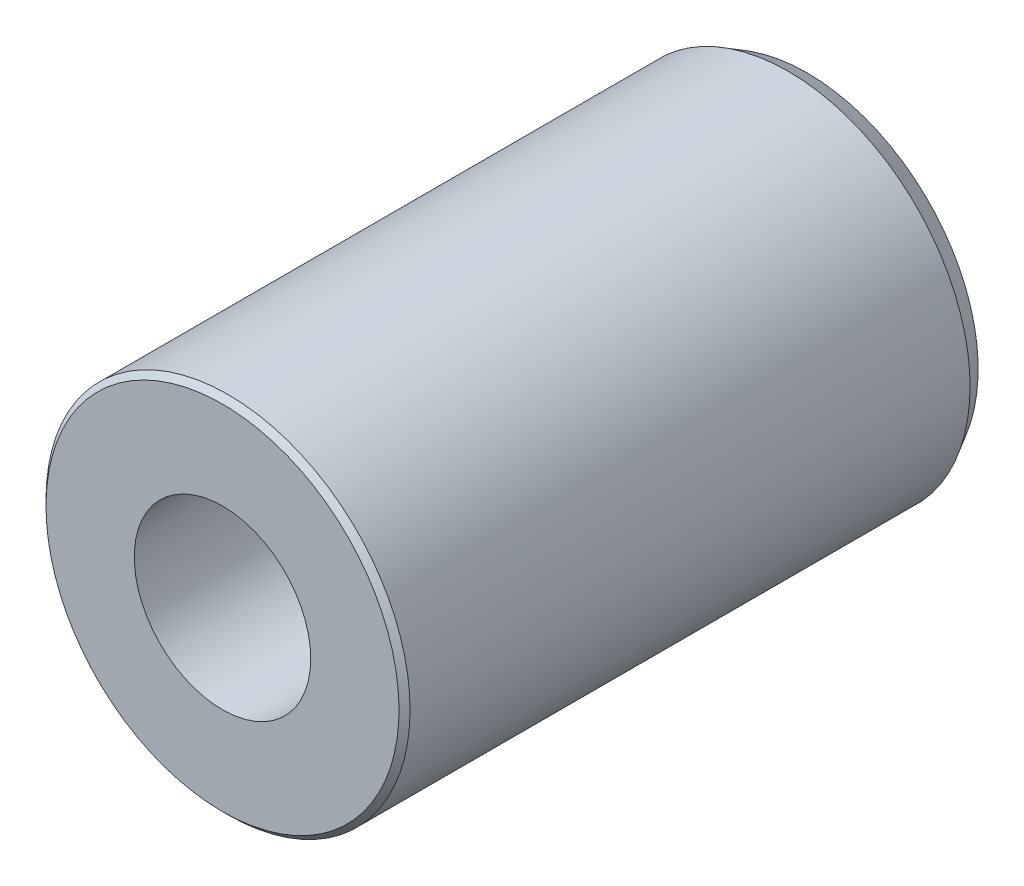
ISO-10303-21;
HEADER;
FILE_DESCRIPTION(('STEP AP214'),'2;1');
FILE_NAME('part.step','',(''),(''),'','','');
FILE_SCHEMA(('AUTOMOTIVE_DESIGN { 1 0 10303 214 1 1 1 1 }'));
ENDSEC;
DATA;
#1=APPLICATION_CONTEXT('core data for automotive mechanical design processes');
#2=APPLICATION_PROTOCOL_DEFINITION('international standard','automotive_design',2000,#1);
#3=PRODUCT_CONTEXT('',#1,'mechanical');
#4=PRODUCT('Part','Part','',(#3));
#5=PRODUCT_RELATED_PRODUCT_CATEGORY('part','',(#4));
#6=PRODUCT_DEFINITION_FORMATION('','',#4);
#7=PRODUCT_DEFINITION_CONTEXT('part definition',#1,'design');
#8=PRODUCT_DEFINITION('design','',#6,#7);
#9=PRODUCT_DEFINITION_SHAPE('','',#8);
#10=(LENGTH_UNIT() NAMED_UNIT(*) SI_UNIT(.MILLI.,.METRE.));
#11=(NAMED_UNIT(*) PLANE_ANGLE_UNIT() SI_UNIT($,.RADIAN.));
#12=(NAMED_UNIT(*) SI_UNIT($,.STERADIAN.) SOLID_ANGLE_UNIT());
#13=UNCERTAINTY_MEASURE_WITH_UNIT(LENGTH_MEASURE(1.E-05),#10,'distance_accuracy_value','');
#14=(GEOMETRIC_REPRESENTATION_CONTEXT(3) GLOBAL_UNCERTAINTY_ASSIGNED_CONTEXT((#13)) GLOBAL_UNIT_ASSIGNED_CONTEXT((#10,
#11,#12)) REPRESENTATION_CONTEXT('',''));
#15=CARTESIAN_POINT('',(0.,0.,0.));
#16=DIRECTION('',(0.,0.,1.));
#17=DIRECTION('',(1.,0.,0.));
#18=AXIS2_PLACEMENT_3D('',#15,#16,#17);
#19=CARTESIAN_POINT('',(0.,0.,53.));
#20=DIRECTION('',(0.,0.,1.));
#21=DIRECTION('',(0.,-1.,0.));
#22=AXIS2_PLACEMENT_3D('',#19,#20,#21);
#23=PLANE('',#22);
#24=CARTESIAN_POINT('',(0.,0.,53.));
#25=DIRECTION('',(0.,0.,1.));
#26=DIRECTION('',(0.,-1.,0.));
#27=AXIS2_PLACEMENT_3D('',#24,#25,#26);
#28=CIRCLE('',#27,16.);
#29=CARTESIAN_POINT('',(0.,-16.,53.));
#30=VERTEX_POINT('',#29);
#31=EDGE_CURVE('E29',#30,#30,#28,.T.);
#32=ORIENTED_EDGE('',*,*,#31,.T.);
#33=EDGE_LOOP('',(#32));
#34=FACE_BOUND('',#33,.T.);
#35=CARTESIAN_POINT('',(0.,0.,53.));
#36=DIRECTION('',(0.,0.,1.));
#37=DIRECTION('',(1.,0.,0.));
#38=AXIS2_PLACEMENT_3D('',#35,#36,#37);
#39=CIRCLE('',#38,8.);
#40=CARTESIAN_POINT('',(8.,0.,53.));
#41=VERTEX_POINT('',#40);
#42=EDGE_CURVE('E37',#41,#41,#39,.T.);
#43=ORIENTED_EDGE('',*,*,#42,.F.);
#44=EDGE_LOOP('',(#43));
#45=FACE_BOUND('',#44,.T.);
#46=ADVANCED_FACE('F14',(#34,#45),#23,.T.);
#47=CARTESIAN_POINT('',(0.,0.,0.));
#48=DIRECTION('',(0.,0.,1.));
#49=DIRECTION('',(0.,-1.,0.));
#50=AXIS2_PLACEMENT_3D('',#47,#48,#49);
#51=PLANE('',#50);
#52=CARTESIAN_POINT('',(0.,0.,0.));
#53=DIRECTION('',(0.,0.,1.));
#54=DIRECTION('',(0.,-1.,0.));
#55=AXIS2_PLACEMENT_3D('',#52,#53,#54);
#56=CIRCLE('',#55,15.5);
#57=CARTESIAN_POINT('',(0.,-15.5,0.));
#58=VERTEX_POINT('',#57);
#59=EDGE_CURVE('E10',#58,#58,#56,.F.);
#60=ORIENTED_EDGE('',*,*,#59,.T.);
#61=EDGE_LOOP('',(#60));
#62=FACE_BOUND('',#61,.T.);
#63=CARTESIAN_POINT('',(0.,0.,0.));
#64=DIRECTION('',(0.,0.,1.));
#65=DIRECTION('',(0.,-1.,0.));
#66=AXIS2_PLACEMENT_3D('',#63,#64,#65);
#67=CIRCLE('',#66,8.);
#68=CARTESIAN_POINT('',(0.,-8.,0.));
#69=VERTEX_POINT('',#68);
#70=EDGE_CURVE('E34',#69,#69,#67,.F.);
#71=ORIENTED_EDGE('',*,*,#70,.F.);
#72=EDGE_LOOP('',(#71));
#73=FACE_BOUND('',#72,.T.);
#74=ADVANCED_FACE('F45',(#62,#73),#51,.F.);
#75=CARTESIAN_POINT('',(0.,0.,53.));
#76=DIRECTION('',(0.,0.,-1.));
#77=DIRECTION('',(0.,1.,0.));
#78=AXIS2_PLACEMENT_3D('',#75,#76,#77);
#79=CYLINDRICAL_SURFACE('',#78,16.5);
#80=CARTESIAN_POINT('',(0.,0.,1.73205080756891));
#81=DIRECTION('',(0.,0.,1.));
#82=DIRECTION('',(0.,-1.,0.));
#83=AXIS2_PLACEMENT_3D('',#80,#81,#82);
#84=CIRCLE('',#83,16.5);
#85=CARTESIAN_POINT('',(0.,-16.5,1.73205080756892));
#86=VERTEX_POINT('',#85);
#87=EDGE_CURVE('E21',#86,#86,#84,.T.);
#88=ORIENTED_EDGE('',*,*,#87,.T.);
#89=EDGE_LOOP('',(#88));
#90=FACE_BOUND('',#89,.T.);
#91=CARTESIAN_POINT('',(0.,0.,52.5));
#92=DIRECTION('',(0.,0.,1.));
#93=DIRECTION('',(0.,-1.,0.));
#94=AXIS2_PLACEMENT_3D('',#91,#92,#93);
#95=CIRCLE('',#94,16.5);
#96=CARTESIAN_POINT('',(0.,-16.5,52.5));
#97=VERTEX_POINT('',#96);
#98=EDGE_CURVE('E25',#97,#97,#95,.F.);
#99=ORIENTED_EDGE('',*,*,#98,.T.);
#100=EDGE_LOOP('',(#99));
#101=FACE_BOUND('',#100,.T.);
#102=ADVANCED_FACE('F16',(#90,#101),#79,.T.);
#103=CARTESIAN_POINT('',(0.,0.,53.));
#104=DIRECTION('',(0.,0.,1.));
#105=DIRECTION('',(1.,0.,0.));
#106=AXIS2_PLACEMENT_3D('',#103,#104,#105);
#107=CYLINDRICAL_SURFACE('',#106,8.);
#108=ORIENTED_EDGE('',*,*,#42,.T.);
#109=EDGE_LOOP('',(#108));
#110=FACE_BOUND('',#109,.T.);
#111=ORIENTED_EDGE('',*,*,#70,.T.);
#112=EDGE_LOOP('',(#111));
#113=FACE_BOUND('',#112,.T.);
#114=ADVANCED_FACE('F41',(#110,#113),#107,.F.);
#115=CARTESIAN_POINT('',(0.,0.,53.));
#116=DIRECTION('',(0.,0.,-1.));
#117=DIRECTION('',(0.,1.,0.));
#118=AXIS2_PLACEMENT_3D('',#115,#116,#117);
#119=CONICAL_SURFACE('',#118,16.,0.785398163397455);
#120=ORIENTED_EDGE('',*,*,#98,.F.);
#121=EDGE_LOOP('',(#120));
#122=FACE_BOUND('',#121,.T.);
#123=ORIENTED_EDGE('',*,*,#31,.F.);
#124=EDGE_LOOP('',(#123));
#125=FACE_BOUND('',#124,.T.);
#126=ADVANCED_FACE('F56',(#122,#125),#119,.T.);
#127=CARTESIAN_POINT('',(0.,0.,1.73205080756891));
#128=DIRECTION('',(0.,0.,1.));
#129=DIRECTION('',(0.,-1.,0.));
#130=AXIS2_PLACEMENT_3D('',#127,#128,#129);
#131=CONICAL_SURFACE('',#130,16.5,0.523598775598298);
#132=ORIENTED_EDGE('',*,*,#59,.F.);
#133=EDGE_LOOP('',(#132));
#134=FACE_BOUND('',#133,.T.);
#135=ORIENTED_EDGE('',*,*,#87,.F.);
#136=EDGE_LOOP('',(#135));
#137=FACE_BOUND('',#136,.T.);
#138=ADVANCED_FACE('F59',(#134,#137),#131,.T.);
#139=CLOSED_SHELL('',(#46,#74,#102,#114,#126,#138));
#140=MANIFOLD_SOLID_BREP('B1',#139);
#141=ADVANCED_BREP_SHAPE_REPRESENTATION('',(#18,#140),#14);
#142=SHAPE_DEFINITION_REPRESENTATION(#9,#141);
ENDSEC;
END-ISO-10303-21;
